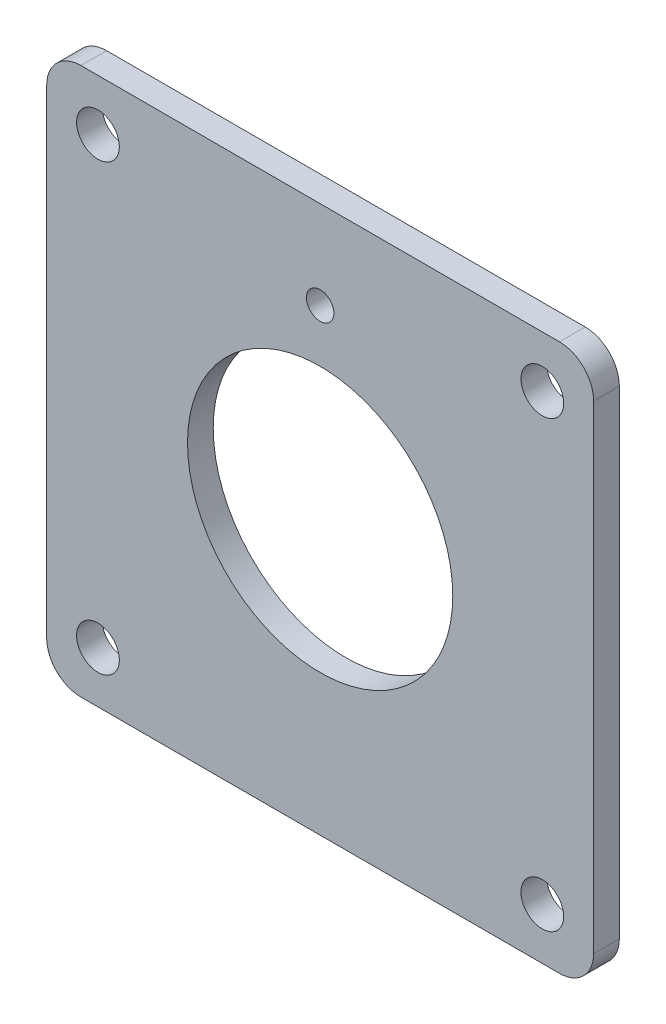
ISO-10303-21;
HEADER;
FILE_DESCRIPTION(('STEP AP214'),'2;1');
FILE_NAME('part.step','',(''),(''),'','','');
FILE_SCHEMA(('AUTOMOTIVE_DESIGN { 1 0 10303 214 1 1 1 1 }'));
ENDSEC;
DATA;
#1=APPLICATION_CONTEXT('core data for automotive mechanical design processes');
#2=APPLICATION_PROTOCOL_DEFINITION('international standard','automotive_design',2000,#1);
#3=PRODUCT_CONTEXT('',#1,'mechanical');
#4=PRODUCT('Part','Part','',(#3));
#5=PRODUCT_RELATED_PRODUCT_CATEGORY('part','',(#4));
#6=PRODUCT_DEFINITION_FORMATION('','',#4);
#7=PRODUCT_DEFINITION_CONTEXT('part definition',#1,'design');
#8=PRODUCT_DEFINITION('design','',#6,#7);
#9=PRODUCT_DEFINITION_SHAPE('','',#8);
#10=(LENGTH_UNIT() NAMED_UNIT(*) SI_UNIT(.MILLI.,.METRE.));
#11=(NAMED_UNIT(*) PLANE_ANGLE_UNIT() SI_UNIT($,.RADIAN.));
#12=(NAMED_UNIT(*) SI_UNIT($,.STERADIAN.) SOLID_ANGLE_UNIT());
#13=UNCERTAINTY_MEASURE_WITH_UNIT(LENGTH_MEASURE(1.E-05),#10,'distance_accuracy_value','');
#14=(GEOMETRIC_REPRESENTATION_CONTEXT(3) GLOBAL_UNCERTAINTY_ASSIGNED_CONTEXT((#13)) GLOBAL_UNIT_ASSIGNED_CONTEXT((#10,
#11,#12)) REPRESENTATION_CONTEXT('',''));
#15=CARTESIAN_POINT('',(0.,0.,0.));
#16=DIRECTION('',(0.,0.,1.));
#17=DIRECTION('',(1.,0.,0.));
#18=AXIS2_PLACEMENT_3D('',#15,#16,#17);
#19=CARTESIAN_POINT('',(-44.45,44.45,0.));
#20=DIRECTION('',(0.,0.,1.));
#21=DIRECTION('',(1.,0.,0.));
#22=AXIS2_PLACEMENT_3D('',#19,#20,#21);
#23=PLANE('',#22);
#24=CARTESIAN_POINT('',(41.275,-41.275,0.));
#25=DIRECTION('',(0.,0.,-1.));
#26=DIRECTION('',(-1.,0.,0.));
#27=AXIS2_PLACEMENT_3D('',#24,#25,#26);
#28=CIRCLE('',#27,3.96874999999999);
#29=CARTESIAN_POINT('',(37.30625,-41.275,0.));
#30=VERTEX_POINT('',#29);
#31=EDGE_CURVE('E191',#30,#30,#28,.T.);
#32=ORIENTED_EDGE('',*,*,#31,.F.);
#33=EDGE_LOOP('',(#32));
#34=FACE_BOUND('',#33,.T.);
#35=CARTESIAN_POINT('',(-41.275,-41.275,0.));
#36=DIRECTION('',(0.,0.,-1.));
#37=DIRECTION('',(-1.,0.,0.));
#38=AXIS2_PLACEMENT_3D('',#35,#36,#37);
#39=CIRCLE('',#38,3.96874999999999);
#40=CARTESIAN_POINT('',(-45.24375,-41.275,0.));
#41=VERTEX_POINT('',#40);
#42=EDGE_CURVE('E185',#41,#41,#39,.T.);
#43=ORIENTED_EDGE('',*,*,#42,.F.);
#44=EDGE_LOOP('',(#43));
#45=FACE_BOUND('',#44,.T.);
#46=CARTESIAN_POINT('',(0.,0.,0.));
#47=DIRECTION('',(0.,0.,1.));
#48=DIRECTION('',(1.,0.,0.));
#49=AXIS2_PLACEMENT_3D('',#46,#47,#48);
#50=CIRCLE('',#49,24.638);
#51=CARTESIAN_POINT('',(24.638,0.,0.));
#52=VERTEX_POINT('',#51);
#53=EDGE_CURVE('E177',#52,#52,#50,.T.);
#54=ORIENTED_EDGE('',*,*,#53,.T.);
#55=EDGE_LOOP('',(#54));
#56=FACE_BOUND('',#55,.T.);
#57=CARTESIAN_POINT('',(-44.45,44.45,0.));
#58=DIRECTION('',(0.,0.,1.));
#59=DIRECTION('',(1.,0.,0.));
#60=AXIS2_PLACEMENT_3D('',#57,#58,#59);
#61=CIRCLE('',#60,6.35);
#62=CARTESIAN_POINT('',(-44.45,50.8,0.));
#63=VERTEX_POINT('',#62);
#64=CARTESIAN_POINT('',(-50.8,44.45,0.));
#65=VERTEX_POINT('',#64);
#66=EDGE_CURVE('E129',#63,#65,#61,.T.);
#67=ORIENTED_EDGE('',*,*,#66,.F.);
#68=DIRECTION('',(-1.,0.,0.));
#69=VECTOR('',#68,1.);
#70=CARTESIAN_POINT('',(44.45,50.8,0.));
#71=LINE('',#70,#69);
#72=CARTESIAN_POINT('',(44.45,50.8,0.));
#73=VERTEX_POINT('',#72);
#74=EDGE_CURVE('E84',#73,#63,#71,.T.);
#75=ORIENTED_EDGE('',*,*,#74,.F.);
#76=CARTESIAN_POINT('',(44.45,44.45,0.));
#77=DIRECTION('',(0.,0.,1.));
#78=DIRECTION('',(1.,0.,0.));
#79=AXIS2_PLACEMENT_3D('',#76,#77,#78);
#80=CIRCLE('',#79,6.35);
#81=CARTESIAN_POINT('',(50.8,44.45,0.));
#82=VERTEX_POINT('',#81);
#83=EDGE_CURVE('E78',#82,#73,#80,.T.);
#84=ORIENTED_EDGE('',*,*,#83,.F.);
#85=DIRECTION('',(0.,1.,0.));
#86=VECTOR('',#85,1.);
#87=CARTESIAN_POINT('',(50.8,-44.45,0.));
#88=LINE('',#87,#86);
#89=CARTESIAN_POINT('',(50.8,-44.45,0.));
#90=VERTEX_POINT('',#89);
#91=EDGE_CURVE('E119',#90,#82,#88,.T.);
#92=ORIENTED_EDGE('',*,*,#91,.F.);
#93=CARTESIAN_POINT('',(44.45,-44.45,0.));
#94=DIRECTION('',(0.,0.,1.));
#95=DIRECTION('',(1.,0.,0.));
#96=AXIS2_PLACEMENT_3D('',#93,#94,#95);
#97=CIRCLE('',#96,6.35);
#98=CARTESIAN_POINT('',(44.45,-50.8,0.));
#99=VERTEX_POINT('',#98);
#100=EDGE_CURVE('E139',#99,#90,#97,.T.);
#101=ORIENTED_EDGE('',*,*,#100,.F.);
#102=DIRECTION('',(1.,0.,0.));
#103=VECTOR('',#102,1.);
#104=CARTESIAN_POINT('',(-44.45,-50.8,0.));
#105=LINE('',#104,#103);
#106=CARTESIAN_POINT('',(-44.45,-50.8,0.));
#107=VERTEX_POINT('',#106);
#108=EDGE_CURVE('E137',#107,#99,#105,.T.);
#109=ORIENTED_EDGE('',*,*,#108,.F.);
#110=CARTESIAN_POINT('',(-44.45,-44.45,0.));
#111=DIRECTION('',(0.,0.,1.));
#112=DIRECTION('',(1.,0.,0.));
#113=AXIS2_PLACEMENT_3D('',#110,#111,#112);
#114=CIRCLE('',#113,6.35);
#115=CARTESIAN_POINT('',(-50.8,-44.45,0.));
#116=VERTEX_POINT('',#115);
#117=EDGE_CURVE('E135',#116,#107,#114,.T.);
#118=ORIENTED_EDGE('',*,*,#117,.F.);
#119=DIRECTION('',(0.,-1.,0.));
#120=VECTOR('',#119,1.);
#121=CARTESIAN_POINT('',(-50.8,44.45,0.));
#122=LINE('',#121,#120);
#123=EDGE_CURVE('E132',#65,#116,#122,.T.);
#124=ORIENTED_EDGE('',*,*,#123,.F.);
#125=EDGE_LOOP('',(#67,#75,#84,#92,#101,#109,#118,#124));
#126=FACE_BOUND('',#125,.T.);
#127=CARTESIAN_POINT('',(41.275,41.275,0.));
#128=DIRECTION('',(0.,0.,-1.));
#129=DIRECTION('',(-1.,0.,0.));
#130=AXIS2_PLACEMENT_3D('',#127,#128,#129);
#131=CIRCLE('',#130,3.96874999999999);
#132=CARTESIAN_POINT('',(37.30625,41.275,0.));
#133=VERTEX_POINT('',#132);
#134=EDGE_CURVE('E197',#133,#133,#131,.T.);
#135=ORIENTED_EDGE('',*,*,#134,.F.);
#136=EDGE_LOOP('',(#135));
#137=FACE_BOUND('',#136,.T.);
#138=CARTESIAN_POINT('',(-41.275,41.275,0.));
#139=DIRECTION('',(0.,0.,-1.));
#140=DIRECTION('',(-1.,0.,0.));
#141=AXIS2_PLACEMENT_3D('',#138,#139,#140);
#142=CIRCLE('',#141,3.96874999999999);
#143=CARTESIAN_POINT('',(-45.24375,41.275,0.));
#144=VERTEX_POINT('',#143);
#145=EDGE_CURVE('E203',#144,#144,#142,.T.);
#146=ORIENTED_EDGE('',*,*,#145,.F.);
#147=EDGE_LOOP('',(#146));
#148=FACE_BOUND('',#147,.T.);
#149=CARTESIAN_POINT('',(0.,34.417,0.));
#150=DIRECTION('',(0.,0.,-1.));
#151=DIRECTION('',(-1.,0.,0.));
#152=AXIS2_PLACEMENT_3D('',#149,#150,#151);
#153=CIRCLE('',#152,2.55269999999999);
#154=CARTESIAN_POINT('',(-2.55269999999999,34.417,0.));
#155=VERTEX_POINT('',#154);
#156=EDGE_CURVE('E209',#155,#155,#153,.T.);
#157=ORIENTED_EDGE('',*,*,#156,.F.);
#158=EDGE_LOOP('',(#157));
#159=FACE_BOUND('',#158,.T.);
#160=ADVANCED_FACE('F32',(#34,#45,#56,#126,#137,#148,#159),#23,.F.);
#161=CARTESIAN_POINT('',(-44.45,44.45,4.7752));
#162=DIRECTION('',(0.,0.,-1.));
#163=DIRECTION('',(-1.,0.,0.));
#164=AXIS2_PLACEMENT_3D('',#161,#162,#163);
#165=CYLINDRICAL_SURFACE('',#164,6.35);
#166=ORIENTED_EDGE('',*,*,#66,.T.);
#167=DIRECTION('',(0.,0.,-1.));
#168=VECTOR('',#167,1.);
#169=CARTESIAN_POINT('',(-50.8,44.45,4.7752));
#170=LINE('',#169,#168);
#171=CARTESIAN_POINT('',(-50.8,44.45,4.7752));
#172=VERTEX_POINT('',#171);
#173=EDGE_CURVE('E11',#172,#65,#170,.T.);
#174=ORIENTED_EDGE('',*,*,#173,.F.);
#175=CARTESIAN_POINT('',(-44.45,44.45,4.7752));
#176=DIRECTION('',(0.,0.,1.));
#177=DIRECTION('',(1.,0.,0.));
#178=AXIS2_PLACEMENT_3D('',#175,#176,#177);
#179=CIRCLE('',#178,6.35);
#180=CARTESIAN_POINT('',(-44.45,50.8,4.7752));
#181=VERTEX_POINT('',#180);
#182=EDGE_CURVE('E144',#181,#172,#179,.T.);
#183=ORIENTED_EDGE('',*,*,#182,.F.);
#184=DIRECTION('',(0.,0.,-1.));
#185=VECTOR('',#184,1.);
#186=CARTESIAN_POINT('',(-44.45,50.8,4.7752));
#187=LINE('',#186,#185);
#188=EDGE_CURVE('E125',#181,#63,#187,.T.);
#189=ORIENTED_EDGE('',*,*,#188,.T.);
#190=EDGE_LOOP('',(#166,#174,#183,#189));
#191=FACE_BOUND('',#190,.T.);
#192=ADVANCED_FACE('F34',(#191),#165,.T.);
#193=CARTESIAN_POINT('',(-50.8,44.45,4.7752));
#194=DIRECTION('',(1.,0.,0.));
#195=DIRECTION('',(0.,1.,0.));
#196=AXIS2_PLACEMENT_3D('',#193,#194,#195);
#197=PLANE('',#196);
#198=ORIENTED_EDGE('',*,*,#123,.T.);
#199=DIRECTION('',(0.,0.,-1.));
#200=VECTOR('',#199,1.);
#201=CARTESIAN_POINT('',(-50.8,-44.45,4.7752));
#202=LINE('',#201,#200);
#203=CARTESIAN_POINT('',(-50.8,-44.45,4.7752));
#204=VERTEX_POINT('',#203);
#205=EDGE_CURVE('E41',#204,#116,#202,.T.);
#206=ORIENTED_EDGE('',*,*,#205,.F.);
#207=DIRECTION('',(0.,-1.,0.));
#208=VECTOR('',#207,1.);
#209=CARTESIAN_POINT('',(-50.8,44.45,4.7752));
#210=LINE('',#209,#208);
#211=EDGE_CURVE('E92',#172,#204,#210,.T.);
#212=ORIENTED_EDGE('',*,*,#211,.F.);
#213=ORIENTED_EDGE('',*,*,#173,.T.);
#214=EDGE_LOOP('',(#198,#206,#212,#213));
#215=FACE_BOUND('',#214,.T.);
#216=ADVANCED_FACE('F222',(#215),#197,.F.);
#217=CARTESIAN_POINT('',(-44.45,-44.45,4.7752));
#218=DIRECTION('',(0.,0.,-1.));
#219=DIRECTION('',(-1.,0.,0.));
#220=AXIS2_PLACEMENT_3D('',#217,#218,#219);
#221=CYLINDRICAL_SURFACE('',#220,6.35);
#222=ORIENTED_EDGE('',*,*,#117,.T.);
#223=DIRECTION('',(0.,0.,-1.));
#224=VECTOR('',#223,1.);
#225=CARTESIAN_POINT('',(-44.45,-50.8,4.7752));
#226=LINE('',#225,#224);
#227=CARTESIAN_POINT('',(-44.45,-50.8,4.7752));
#228=VERTEX_POINT('',#227);
#229=EDGE_CURVE('E151',#228,#107,#226,.T.);
#230=ORIENTED_EDGE('',*,*,#229,.F.);
#231=CARTESIAN_POINT('',(-44.45,-44.45,4.7752));
#232=DIRECTION('',(0.,0.,1.));
#233=DIRECTION('',(1.,0.,0.));
#234=AXIS2_PLACEMENT_3D('',#231,#232,#233);
#235=CIRCLE('',#234,6.35);
#236=EDGE_CURVE('E159',#204,#228,#235,.T.);
#237=ORIENTED_EDGE('',*,*,#236,.F.);
#238=ORIENTED_EDGE('',*,*,#205,.T.);
#239=EDGE_LOOP('',(#222,#230,#237,#238));
#240=FACE_BOUND('',#239,.T.);
#241=ADVANCED_FACE('F157',(#240),#221,.T.);
#242=CARTESIAN_POINT('',(-44.45,-50.8,4.7752));
#243=DIRECTION('',(0.,1.,0.));
#244=DIRECTION('',(0.,0.,1.));
#245=AXIS2_PLACEMENT_3D('',#242,#243,#244);
#246=PLANE('',#245);
#247=ORIENTED_EDGE('',*,*,#108,.T.);
#248=DIRECTION('',(0.,0.,-1.));
#249=VECTOR('',#248,1.);
#250=CARTESIAN_POINT('',(44.45,-50.8,4.7752));
#251=LINE('',#250,#249);
#252=CARTESIAN_POINT('',(44.45,-50.8,4.7752));
#253=VERTEX_POINT('',#252);
#254=EDGE_CURVE('E148',#253,#99,#251,.T.);
#255=ORIENTED_EDGE('',*,*,#254,.F.);
#256=DIRECTION('',(1.,0.,0.));
#257=VECTOR('',#256,1.);
#258=CARTESIAN_POINT('',(-44.45,-50.8,4.7752));
#259=LINE('',#258,#257);
#260=EDGE_CURVE('E171',#228,#253,#259,.T.);
#261=ORIENTED_EDGE('',*,*,#260,.F.);
#262=ORIENTED_EDGE('',*,*,#229,.T.);
#263=EDGE_LOOP('',(#247,#255,#261,#262));
#264=FACE_BOUND('',#263,.T.);
#265=ADVANCED_FACE('F167',(#264),#246,.F.);
#266=CARTESIAN_POINT('',(44.45,-44.45,4.7752));
#267=DIRECTION('',(0.,0.,-1.));
#268=DIRECTION('',(-1.,0.,0.));
#269=AXIS2_PLACEMENT_3D('',#266,#267,#268);
#270=CYLINDRICAL_SURFACE('',#269,6.35);
#271=ORIENTED_EDGE('',*,*,#100,.T.);
#272=DIRECTION('',(0.,0.,-1.));
#273=VECTOR('',#272,1.);
#274=CARTESIAN_POINT('',(50.8,-44.45,4.7752));
#275=LINE('',#274,#273);
#276=CARTESIAN_POINT('',(50.8,-44.45,4.7752));
#277=VERTEX_POINT('',#276);
#278=EDGE_CURVE('E120',#277,#90,#275,.T.);
#279=ORIENTED_EDGE('',*,*,#278,.F.);
#280=CARTESIAN_POINT('',(44.45,-44.45,4.7752));
#281=DIRECTION('',(0.,0.,1.));
#282=DIRECTION('',(1.,0.,0.));
#283=AXIS2_PLACEMENT_3D('',#280,#281,#282);
#284=CIRCLE('',#283,6.35);
#285=EDGE_CURVE('E111',#253,#277,#284,.T.);
#286=ORIENTED_EDGE('',*,*,#285,.F.);
#287=ORIENTED_EDGE('',*,*,#254,.T.);
#288=EDGE_LOOP('',(#271,#279,#286,#287));
#289=FACE_BOUND('',#288,.T.);
#290=ADVANCED_FACE('F170',(#289),#270,.T.);
#291=CARTESIAN_POINT('',(50.8,-44.45,4.7752));
#292=DIRECTION('',(-1.,0.,0.));
#293=DIRECTION('',(0.,0.,1.));
#294=AXIS2_PLACEMENT_3D('',#291,#292,#293);
#295=PLANE('',#294);
#296=ORIENTED_EDGE('',*,*,#91,.T.);
#297=DIRECTION('',(0.,0.,-1.));
#298=VECTOR('',#297,1.);
#299=CARTESIAN_POINT('',(50.8,44.45,4.7752));
#300=LINE('',#299,#298);
#301=CARTESIAN_POINT('',(50.8,44.45,4.7752));
#302=VERTEX_POINT('',#301);
#303=EDGE_CURVE('E116',#302,#82,#300,.T.);
#304=ORIENTED_EDGE('',*,*,#303,.F.);
#305=DIRECTION('',(0.,1.,0.));
#306=VECTOR('',#305,1.);
#307=CARTESIAN_POINT('',(50.8,-44.45,4.7752));
#308=LINE('',#307,#306);
#309=EDGE_CURVE('E105',#277,#302,#308,.T.);
#310=ORIENTED_EDGE('',*,*,#309,.F.);
#311=ORIENTED_EDGE('',*,*,#278,.T.);
#312=EDGE_LOOP('',(#296,#304,#310,#311));
#313=FACE_BOUND('',#312,.T.);
#314=ADVANCED_FACE('F117',(#313),#295,.F.);
#315=CARTESIAN_POINT('',(44.45,44.45,4.7752));
#316=DIRECTION('',(0.,0.,-1.));
#317=DIRECTION('',(-1.,0.,0.));
#318=AXIS2_PLACEMENT_3D('',#315,#316,#317);
#319=CYLINDRICAL_SURFACE('',#318,6.35);
#320=ORIENTED_EDGE('',*,*,#83,.T.);
#321=DIRECTION('',(0.,0.,-1.));
#322=VECTOR('',#321,1.);
#323=CARTESIAN_POINT('',(44.45,50.8,4.7752));
#324=LINE('',#323,#322);
#325=CARTESIAN_POINT('',(44.45,50.8,4.7752));
#326=VERTEX_POINT('',#325);
#327=EDGE_CURVE('E121',#326,#73,#324,.T.);
#328=ORIENTED_EDGE('',*,*,#327,.F.);
#329=CARTESIAN_POINT('',(44.45,44.45,4.7752));
#330=DIRECTION('',(0.,0.,1.));
#331=DIRECTION('',(1.,0.,0.));
#332=AXIS2_PLACEMENT_3D('',#329,#330,#331);
#333=CIRCLE('',#332,6.35);
#334=EDGE_CURVE('E109',#302,#326,#333,.T.);
#335=ORIENTED_EDGE('',*,*,#334,.F.);
#336=ORIENTED_EDGE('',*,*,#303,.T.);
#337=EDGE_LOOP('',(#320,#328,#335,#336));
#338=FACE_BOUND('',#337,.T.);
#339=ADVANCED_FACE('F123',(#338),#319,.T.);
#340=CARTESIAN_POINT('',(44.45,50.8,4.7752));
#341=DIRECTION('',(0.,-1.,0.));
#342=DIRECTION('',(0.,0.,-1.));
#343=AXIS2_PLACEMENT_3D('',#340,#341,#342);
#344=PLANE('',#343);
#345=ORIENTED_EDGE('',*,*,#74,.T.);
#346=ORIENTED_EDGE('',*,*,#188,.F.);
#347=DIRECTION('',(-1.,0.,0.));
#348=VECTOR('',#347,1.);
#349=CARTESIAN_POINT('',(44.45,50.8,4.7752));
#350=LINE('',#349,#348);
#351=EDGE_CURVE('E49',#326,#181,#350,.T.);
#352=ORIENTED_EDGE('',*,*,#351,.F.);
#353=ORIENTED_EDGE('',*,*,#327,.T.);
#354=EDGE_LOOP('',(#345,#346,#352,#353));
#355=FACE_BOUND('',#354,.T.);
#356=ADVANCED_FACE('F229',(#355),#344,.F.);
#357=CARTESIAN_POINT('',(-44.45,44.45,4.7752));
#358=DIRECTION('',(0.,0.,1.));
#359=DIRECTION('',(1.,0.,0.));
#360=AXIS2_PLACEMENT_3D('',#357,#358,#359);
#361=PLANE('',#360);
#362=CARTESIAN_POINT('',(0.,34.417,4.7752));
#363=DIRECTION('',(0.,0.,1.));
#364=DIRECTION('',(1.,0.,0.));
#365=AXIS2_PLACEMENT_3D('',#362,#363,#364);
#366=CIRCLE('',#365,2.55269999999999);
#367=CARTESIAN_POINT('',(2.55269999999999,34.417,4.7752));
#368=VERTEX_POINT('',#367);
#369=EDGE_CURVE('E206',#368,#368,#366,.T.);
#370=ORIENTED_EDGE('',*,*,#369,.F.);
#371=EDGE_LOOP('',(#370));
#372=FACE_BOUND('',#371,.T.);
#373=CARTESIAN_POINT('',(-41.275,41.275,4.7752));
#374=DIRECTION('',(0.,0.,1.));
#375=DIRECTION('',(1.,0.,0.));
#376=AXIS2_PLACEMENT_3D('',#373,#374,#375);
#377=CIRCLE('',#376,3.96874999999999);
#378=CARTESIAN_POINT('',(-37.30625,41.275,4.7752));
#379=VERTEX_POINT('',#378);
#380=EDGE_CURVE('E200',#379,#379,#377,.T.);
#381=ORIENTED_EDGE('',*,*,#380,.F.);
#382=EDGE_LOOP('',(#381));
#383=FACE_BOUND('',#382,.T.);
#384=CARTESIAN_POINT('',(41.275,41.275,4.7752));
#385=DIRECTION('',(0.,0.,1.));
#386=DIRECTION('',(1.,0.,0.));
#387=AXIS2_PLACEMENT_3D('',#384,#385,#386);
#388=CIRCLE('',#387,3.96874999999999);
#389=CARTESIAN_POINT('',(45.24375,41.275,4.7752));
#390=VERTEX_POINT('',#389);
#391=EDGE_CURVE('E194',#390,#390,#388,.T.);
#392=ORIENTED_EDGE('',*,*,#391,.F.);
#393=EDGE_LOOP('',(#392));
#394=FACE_BOUND('',#393,.T.);
#395=CARTESIAN_POINT('',(41.275,-41.275,4.7752));
#396=DIRECTION('',(0.,0.,1.));
#397=DIRECTION('',(1.,0.,0.));
#398=AXIS2_PLACEMENT_3D('',#395,#396,#397);
#399=CIRCLE('',#398,3.96874999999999);
#400=CARTESIAN_POINT('',(45.24375,-41.275,4.7752));
#401=VERTEX_POINT('',#400);
#402=EDGE_CURVE('E188',#401,#401,#399,.T.);
#403=ORIENTED_EDGE('',*,*,#402,.F.);
#404=EDGE_LOOP('',(#403));
#405=FACE_BOUND('',#404,.T.);
#406=CARTESIAN_POINT('',(-41.275,-41.275,4.7752));
#407=DIRECTION('',(0.,0.,1.));
#408=DIRECTION('',(1.,0.,0.));
#409=AXIS2_PLACEMENT_3D('',#406,#407,#408);
#410=CIRCLE('',#409,3.96874999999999);
#411=CARTESIAN_POINT('',(-37.30625,-41.275,4.7752));
#412=VERTEX_POINT('',#411);
#413=EDGE_CURVE('E180',#412,#412,#410,.T.);
#414=ORIENTED_EDGE('',*,*,#413,.F.);
#415=EDGE_LOOP('',(#414));
#416=FACE_BOUND('',#415,.T.);
#417=CARTESIAN_POINT('',(0.,0.,4.7752));
#418=DIRECTION('',(0.,0.,1.));
#419=DIRECTION('',(1.,0.,0.));
#420=AXIS2_PLACEMENT_3D('',#417,#418,#419);
#421=CIRCLE('',#420,24.638);
#422=CARTESIAN_POINT('',(24.638,0.,4.7752));
#423=VERTEX_POINT('',#422);
#424=EDGE_CURVE('E133',#423,#423,#421,.T.);
#425=ORIENTED_EDGE('',*,*,#424,.F.);
#426=EDGE_LOOP('',(#425));
#427=FACE_BOUND('',#426,.T.);
#428=ORIENTED_EDGE('',*,*,#182,.T.);
#429=ORIENTED_EDGE('',*,*,#211,.T.);
#430=ORIENTED_EDGE('',*,*,#236,.T.);
#431=ORIENTED_EDGE('',*,*,#260,.T.);
#432=ORIENTED_EDGE('',*,*,#285,.T.);
#433=ORIENTED_EDGE('',*,*,#309,.T.);
#434=ORIENTED_EDGE('',*,*,#334,.T.);
#435=ORIENTED_EDGE('',*,*,#351,.T.);
#436=EDGE_LOOP('',(#428,#429,#430,#431,#432,#433,#434,#435));
#437=FACE_BOUND('',#436,.T.);
#438=ADVANCED_FACE('F107',(#372,#383,#394,#405,#416,#427,#437),#361,.T.);
#439=CARTESIAN_POINT('',(0.,0.,4.7752));
#440=DIRECTION('',(0.,0.,-1.));
#441=DIRECTION('',(-1.,0.,0.));
#442=AXIS2_PLACEMENT_3D('',#439,#440,#441);
#443=CYLINDRICAL_SURFACE('',#442,24.638);
#444=ORIENTED_EDGE('',*,*,#424,.T.);
#445=EDGE_LOOP('',(#444));
#446=FACE_BOUND('',#445,.T.);
#447=ORIENTED_EDGE('',*,*,#53,.F.);
#448=EDGE_LOOP('',(#447));
#449=FACE_BOUND('',#448,.T.);
#450=ADVANCED_FACE('F279',(#446,#449),#443,.F.);
#451=CARTESIAN_POINT('',(-41.275,-41.275,0.));
#452=DIRECTION('',(0.,0.,-1.));
#453=DIRECTION('',(-1.,0.,0.));
#454=AXIS2_PLACEMENT_3D('',#451,#452,#453);
#455=CYLINDRICAL_SURFACE('',#454,3.96874999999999);
#456=ORIENTED_EDGE('',*,*,#42,.T.);
#457=EDGE_LOOP('',(#456));
#458=FACE_BOUND('',#457,.T.);
#459=ORIENTED_EDGE('',*,*,#413,.T.);
#460=EDGE_LOOP('',(#459));
#461=FACE_BOUND('',#460,.T.);
#462=ADVANCED_FACE('F286',(#458,#461),#455,.F.);
#463=CARTESIAN_POINT('',(41.275,-41.275,0.));
#464=DIRECTION('',(0.,0.,-1.));
#465=DIRECTION('',(-1.,0.,0.));
#466=AXIS2_PLACEMENT_3D('',#463,#464,#465);
#467=CYLINDRICAL_SURFACE('',#466,3.96874999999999);
#468=ORIENTED_EDGE('',*,*,#31,.T.);
#469=EDGE_LOOP('',(#468));
#470=FACE_BOUND('',#469,.T.);
#471=ORIENTED_EDGE('',*,*,#402,.T.);
#472=EDGE_LOOP('',(#471));
#473=FACE_BOUND('',#472,.T.);
#474=ADVANCED_FACE('F293',(#470,#473),#467,.F.);
#475=CARTESIAN_POINT('',(41.275,41.275,0.));
#476=DIRECTION('',(0.,0.,-1.));
#477=DIRECTION('',(-1.,0.,0.));
#478=AXIS2_PLACEMENT_3D('',#475,#476,#477);
#479=CYLINDRICAL_SURFACE('',#478,3.96874999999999);
#480=ORIENTED_EDGE('',*,*,#134,.T.);
#481=EDGE_LOOP('',(#480));
#482=FACE_BOUND('',#481,.T.);
#483=ORIENTED_EDGE('',*,*,#391,.T.);
#484=EDGE_LOOP('',(#483));
#485=FACE_BOUND('',#484,.T.);
#486=ADVANCED_FACE('F301',(#482,#485),#479,.F.);
#487=CARTESIAN_POINT('',(-41.275,41.275,0.));
#488=DIRECTION('',(0.,0.,-1.));
#489=DIRECTION('',(-1.,0.,0.));
#490=AXIS2_PLACEMENT_3D('',#487,#488,#489);
#491=CYLINDRICAL_SURFACE('',#490,3.96874999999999);
#492=ORIENTED_EDGE('',*,*,#145,.T.);
#493=EDGE_LOOP('',(#492));
#494=FACE_BOUND('',#493,.T.);
#495=ORIENTED_EDGE('',*,*,#380,.T.);
#496=EDGE_LOOP('',(#495));
#497=FACE_BOUND('',#496,.T.);
#498=ADVANCED_FACE('F309',(#494,#497),#491,.F.);
#499=CARTESIAN_POINT('',(0.,34.417,0.));
#500=DIRECTION('',(0.,0.,-1.));
#501=DIRECTION('',(-1.,0.,0.));
#502=AXIS2_PLACEMENT_3D('',#499,#500,#501);
#503=CYLINDRICAL_SURFACE('',#502,2.55269999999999);
#504=ORIENTED_EDGE('',*,*,#156,.T.);
#505=EDGE_LOOP('',(#504));
#506=FACE_BOUND('',#505,.T.);
#507=ORIENTED_EDGE('',*,*,#369,.T.);
#508=EDGE_LOOP('',(#507));
#509=FACE_BOUND('',#508,.T.);
#510=ADVANCED_FACE('F213',(#506,#509),#503,.F.);
#511=CLOSED_SHELL('',(#160,#192,#216,#241,#265,#290,#314,#339,#356,#438,#450,#462,#474,#486,
#498,#510));
#512=MANIFOLD_SOLID_BREP('B2',#511);
#513=ADVANCED_BREP_SHAPE_REPRESENTATION('',(#18,#512),#14);
#514=SHAPE_DEFINITION_REPRESENTATION(#9,#513);
ENDSEC;
END-ISO-10303-21;
